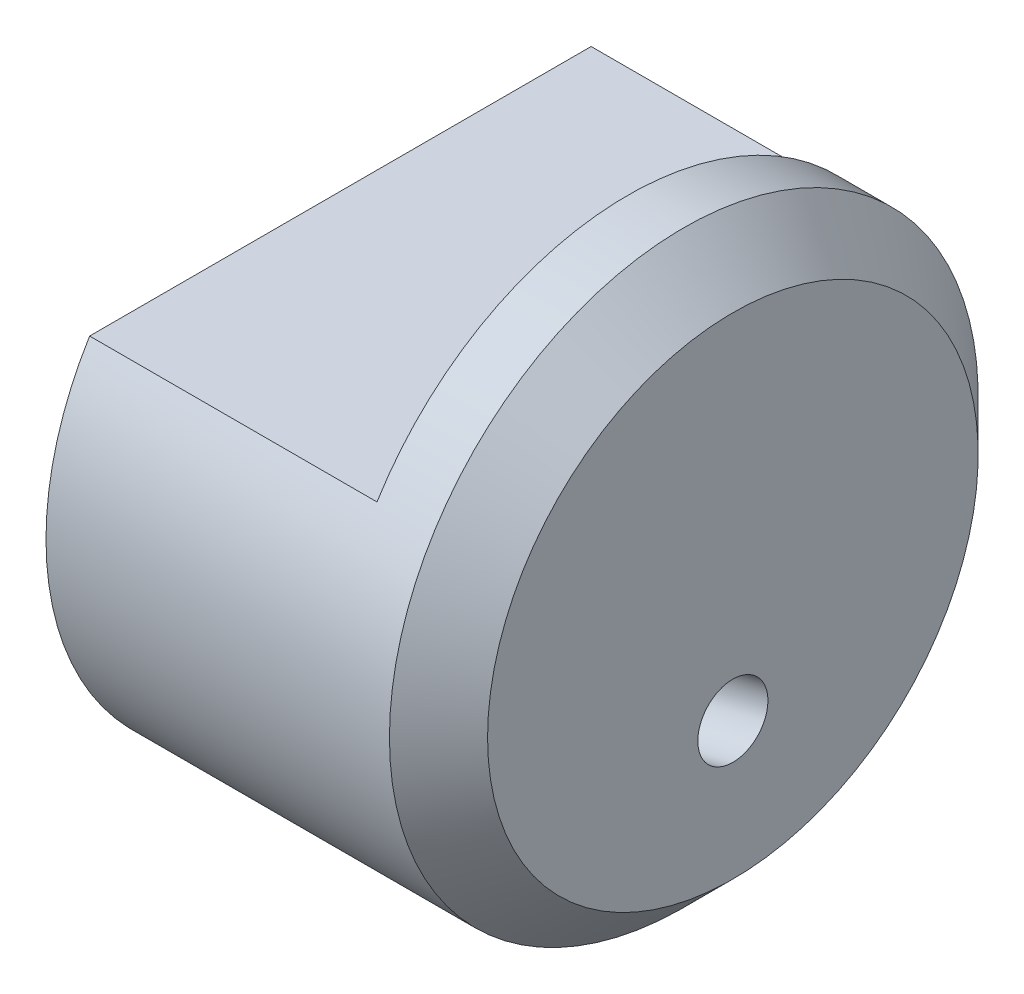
from build123d import *

# Parameters (mm, degrees)
ESQUISSE2_W             = 9.212523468
ESQUISSE2_H             = 4
ENL_V_MAT_EXTRU_1_DEPTH = 4.1
ESQUISSE3_R             = 0.5
ENL_V_MAT_EXTRU_2_DEPTH = 5.1


with BuildPart() as part:
    # Esquisse1 → R_volution1 (revolve)
    with BuildSketch(Plane.XY, mode=Mode.PRIVATE) as r_volution1_sk:
        Polygon((0, 0), (0, -3.5), (-0.7, -4.2), (-5.6, -4.2), (-5.6, -0.75), (-1.5, -0.75), (-1.5, 0), align=None)
    revolve(r_volution1_sk.sketch.rotate(Axis((-1.5, 0, 0), (1, 0, 0)), 270), axis=Axis((-1.5, 0, 0), (1, 0, 0)))

    # Esquisse2 → Enl_v. mat.-Extru.1 (cut)
    with BuildSketch(Plane.ZY.offset(5.6)):
        with Locations((0, 4.2)):
            Rectangle(ESQUISSE2_W, ESQUISSE2_H)
    extrude(amount=-ENL_V_MAT_EXTRU_1_DEPTH, mode=Mode.SUBTRACT)

    # Esquisse3 → Enl_v. mat.-Extru.2 (cut)
    with BuildSketch(Plane(origin=(0, 0, 0), x_dir=(0, 0, -1), z_dir=(-0.9723699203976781, -0.23344536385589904, 0))):
        with Locations(Location((0, 1.5, 0), (0, 0, 270))):
            Circle(ESQUISSE3_R)
    extrude(amount=ENL_V_MAT_EXTRU_2_DEPTH, mode=Mode.SUBTRACT)


solid = part.part
